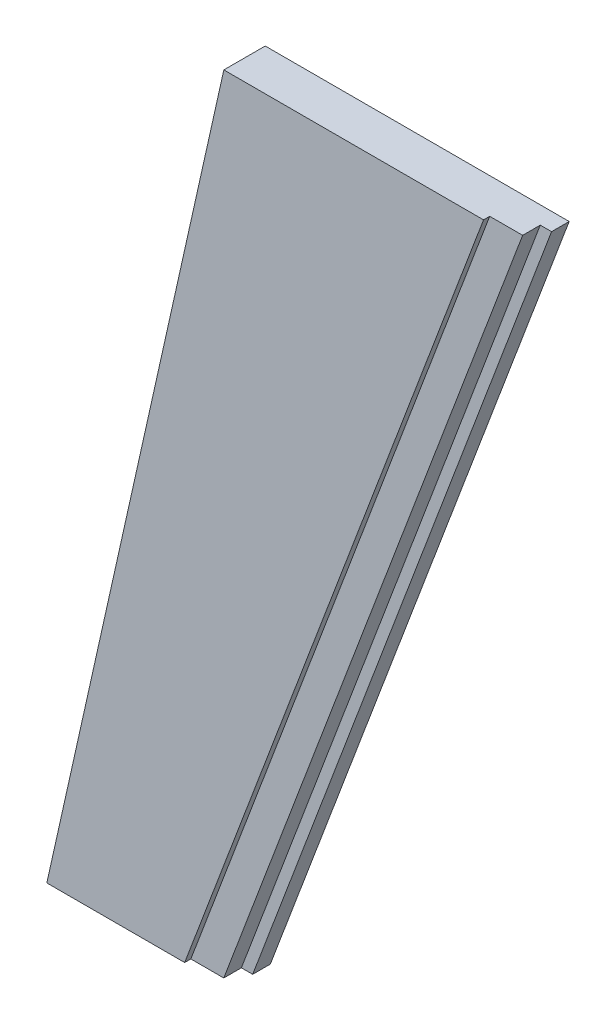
from build123d import *

# Parameters (mm, degrees)
EXTRUDE_1_DEPTH = 47
EXTRUDE_2_DEPTH = 40
EXTRUDE_3_DEPTH = 20


with BuildPart() as part:
    # Sketch 1 → Extrude 1 (new body)
    with BuildSketch(Plane.XY):
        Polygon((-931.846836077, 0), (-1226.738436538, 0), (-1427.719077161, -900), (-1271.209662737, -900), align=None)
    extrude(amount=EXTRUDE_1_DEPTH)

    # Sketch 2 → Extrude 2 (add)
    with BuildSketch(Plane(origin=(0, 0, 0), x_dir=(-1, 0, 0), z_dir=(0, 0, -1))):
        Polygon((931.846836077, 0), (894.441321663, 0), (1233.804148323, -900), (1271.209662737, -900), align=None)
    extrude(amount=-EXTRUDE_2_DEPTH)

    # Sketch 3 → Extrude 3 (add)
    with BuildSketch(Plane(origin=(0, 0, 0), x_dir=(-1, 0, 0), z_dir=(0, 0, -1))):
        Polygon((894.441321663, 0), (881.616573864, 0), (1220.979400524, -900), (1233.804148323, -900), align=None)
    extrude(amount=-EXTRUDE_3_DEPTH)


solid = part.part
